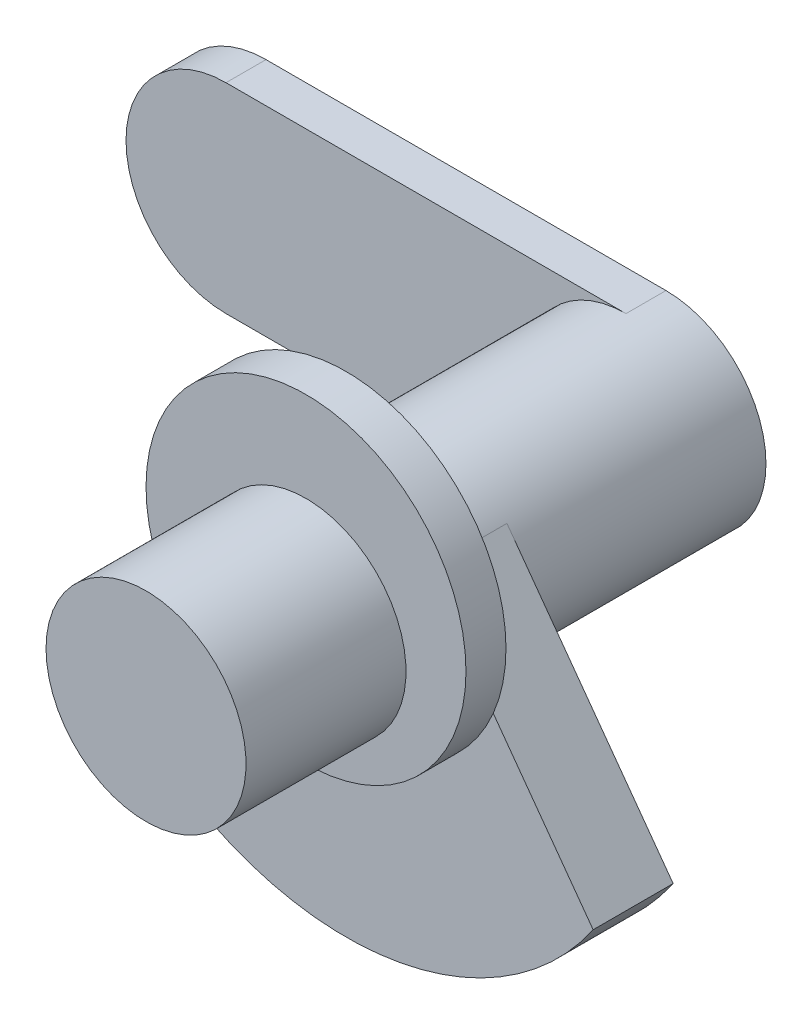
ISO-10303-21;
HEADER;
FILE_DESCRIPTION(('STEP AP214'),'2;1');
FILE_NAME('part.step','',(''),(''),'','','');
FILE_SCHEMA(('AUTOMOTIVE_DESIGN { 1 0 10303 214 1 1 1 1 }'));
ENDSEC;
DATA;
#1=APPLICATION_CONTEXT('core data for automotive mechanical design processes');
#2=APPLICATION_PROTOCOL_DEFINITION('international standard','automotive_design',2000,#1);
#3=PRODUCT_CONTEXT('',#1,'mechanical');
#4=PRODUCT('Part','Part','',(#3));
#5=PRODUCT_RELATED_PRODUCT_CATEGORY('part','',(#4));
#6=PRODUCT_DEFINITION_FORMATION('','',#4);
#7=PRODUCT_DEFINITION_CONTEXT('part definition',#1,'design');
#8=PRODUCT_DEFINITION('design','',#6,#7);
#9=PRODUCT_DEFINITION_SHAPE('','',#8);
#10=(LENGTH_UNIT() NAMED_UNIT(*) SI_UNIT(.MILLI.,.METRE.));
#11=(NAMED_UNIT(*) PLANE_ANGLE_UNIT() SI_UNIT($,.RADIAN.));
#12=(NAMED_UNIT(*) SI_UNIT($,.STERADIAN.) SOLID_ANGLE_UNIT());
#13=UNCERTAINTY_MEASURE_WITH_UNIT(LENGTH_MEASURE(1.E-05),#10,'distance_accuracy_value','');
#14=(GEOMETRIC_REPRESENTATION_CONTEXT(3) GLOBAL_UNCERTAINTY_ASSIGNED_CONTEXT((#13)) GLOBAL_UNIT_ASSIGNED_CONTEXT((#10,
#11,#12)) REPRESENTATION_CONTEXT('',''));
#15=CARTESIAN_POINT('',(0.,0.,0.));
#16=DIRECTION('',(0.,0.,1.));
#17=DIRECTION('',(1.,0.,0.));
#18=AXIS2_PLACEMENT_3D('',#15,#16,#17);
#19=CARTESIAN_POINT('',(0.,0.,152.4));
#20=DIRECTION('',(0.,0.,-1.));
#21=DIRECTION('',(-1.,0.,0.));
#22=AXIS2_PLACEMENT_3D('',#19,#20,#21);
#23=CYLINDRICAL_SURFACE('',#22,63.5);
#24=CARTESIAN_POINT('',(0.,0.,-152.4));
#25=DIRECTION('',(0.,0.,1.));
#26=DIRECTION('',(1.,0.,0.));
#27=AXIS2_PLACEMENT_3D('',#24,#25,#26);
#28=CIRCLE('',#27,63.5);
#29=CARTESIAN_POINT('',(0.,63.5,-152.4));
#30=VERTEX_POINT('',#29);
#31=CARTESIAN_POINT('',(0.,-63.5,-152.4));
#32=VERTEX_POINT('',#31);
#33=EDGE_CURVE('E130',#30,#32,#28,.T.);
#34=ORIENTED_EDGE('',*,*,#33,.T.);
#35=DIRECTION('',(0.,0.,1.));
#36=VECTOR('',#35,1.);
#37=CARTESIAN_POINT('',(0.,-63.5,-177.8));
#38=LINE('',#37,#36);
#39=CARTESIAN_POINT('',(0.,-63.5,-177.8));
#40=VERTEX_POINT('',#39);
#41=EDGE_CURVE('E115',#40,#32,#38,.T.);
#42=ORIENTED_EDGE('',*,*,#41,.F.);
#43=CARTESIAN_POINT('',(0.,0.,-177.8));
#44=DIRECTION('',(0.,0.,-1.));
#45=DIRECTION('',(-1.,0.,0.));
#46=AXIS2_PLACEMENT_3D('',#43,#44,#45);
#47=CIRCLE('',#46,63.5);
#48=CARTESIAN_POINT('',(0.,63.5,-177.8));
#49=VERTEX_POINT('',#48);
#50=EDGE_CURVE('E121',#49,#40,#47,.T.);
#51=ORIENTED_EDGE('',*,*,#50,.F.);
#52=DIRECTION('',(0.,0.,1.));
#53=VECTOR('',#52,1.);
#54=CARTESIAN_POINT('',(0.,63.5,-177.8));
#55=LINE('',#54,#53);
#56=EDGE_CURVE('E53',#49,#30,#55,.T.);
#57=ORIENTED_EDGE('',*,*,#56,.T.);
#58=EDGE_LOOP('',(#34,#42,#51,#57));
#59=FACE_BOUND('',#58,.T.);
#60=DIRECTION('',(0.,0.,1.));
#61=VECTOR('',#60,1.);
#62=CARTESIAN_POINT('',(-51.3725791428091,37.3243635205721,-25.4));
#63=LINE('',#62,#61);
#64=CARTESIAN_POINT('',(-51.3725791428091,37.3243635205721,-25.4));
#65=VERTEX_POINT('',#64);
#66=CARTESIAN_POINT('',(-51.3725791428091,37.3243635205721,25.4));
#67=VERTEX_POINT('',#66);
#68=EDGE_CURVE('E169',#65,#67,#63,.T.);
#69=ORIENTED_EDGE('',*,*,#68,.T.);
#70=CARTESIAN_POINT('',(0.,0.,25.4));
#71=DIRECTION('',(0.,0.,1.));
#72=DIRECTION('',(1.,0.,0.));
#73=AXIS2_PLACEMENT_3D('',#70,#71,#72);
#74=CIRCLE('',#73,63.5);
#75=CARTESIAN_POINT('',(51.3725791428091,37.3243635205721,25.4));
#76=VERTEX_POINT('',#75);
#77=EDGE_CURVE('E11',#76,#67,#74,.T.);
#78=ORIENTED_EDGE('',*,*,#77,.F.);
#79=DIRECTION('',(0.,0.,1.));
#80=VECTOR('',#79,1.);
#81=CARTESIAN_POINT('',(51.3725791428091,37.3243635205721,-25.4));
#82=LINE('',#81,#80);
#83=CARTESIAN_POINT('',(51.3725791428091,37.3243635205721,-25.4));
#84=VERTEX_POINT('',#83);
#85=EDGE_CURVE('E165',#84,#76,#82,.T.);
#86=ORIENTED_EDGE('',*,*,#85,.F.);
#87=CARTESIAN_POINT('',(0.,0.,-25.4));
#88=DIRECTION('',(0.,0.,1.));
#89=DIRECTION('',(1.,0.,0.));
#90=AXIS2_PLACEMENT_3D('',#87,#88,#89);
#91=CIRCLE('',#90,63.5);
#92=EDGE_CURVE('E183',#65,#84,#91,.T.);
#93=ORIENTED_EDGE('',*,*,#92,.F.);
#94=EDGE_LOOP('',(#69,#78,#86,#93));
#95=FACE_BOUND('',#94,.T.);
#96=ADVANCED_FACE('F36',(#59,#95),#23,.T.);
#97=CARTESIAN_POINT('',(0.,0.,50.8));
#98=DIRECTION('',(0.,0.,1.));
#99=DIRECTION('',(1.,0.,0.));
#100=AXIS2_PLACEMENT_3D('',#97,#98,#99);
#101=CIRCLE('',#100,63.5);
#102=CARTESIAN_POINT('',(-63.5,0.,50.8));
#103=VERTEX_POINT('',#102);
#104=EDGE_CURVE('E152',#103,#103,#101,.T.);
#105=CARTESIAN_POINT('',(0.,0.,152.4));
#106=DIRECTION('',(0.,0.,1.));
#107=DIRECTION('',(1.,0.,0.));
#108=AXIS2_PLACEMENT_3D('',#105,#106,#107);
#109=CIRCLE('',#108,63.5);
#110=CARTESIAN_POINT('',(-63.5,0.,152.4));
#111=VERTEX_POINT('',#110);
#112=EDGE_CURVE('E45',#111,#111,#109,.T.);
#113=CARTESIAN_POINT('',(-63.5,0.,50.8));
#114=CARTESIAN_POINT('',(-63.5,0.,51.8583333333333));
#115=CARTESIAN_POINT('',(-63.5,0.,52.9166666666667));
#116=CARTESIAN_POINT('',(-63.5,0.,55.0333333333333));
#117=CARTESIAN_POINT('',(-63.5,0.,56.0916666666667));
#118=CARTESIAN_POINT('',(-63.5,0.,58.2083333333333));
#119=CARTESIAN_POINT('',(-63.5,0.,59.2666666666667));
#120=CARTESIAN_POINT('',(-63.5,0.,61.3833333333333));
#121=CARTESIAN_POINT('',(-63.5,0.,62.4416666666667));
#122=CARTESIAN_POINT('',(-63.5,0.,64.5583333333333));
#123=CARTESIAN_POINT('',(-63.5,0.,65.6166666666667));
#124=CARTESIAN_POINT('',(-63.5,0.,67.7333333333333));
#125=CARTESIAN_POINT('',(-63.5,0.,68.7916666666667));
#126=CARTESIAN_POINT('',(-63.5,0.,70.9083333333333));
#127=CARTESIAN_POINT('',(-63.5,0.,71.9666666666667));
#128=CARTESIAN_POINT('',(-63.5,0.,74.0833333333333));
#129=CARTESIAN_POINT('',(-63.5,0.,75.1416666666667));
#130=CARTESIAN_POINT('',(-63.5,0.,77.2583333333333));
#131=CARTESIAN_POINT('',(-63.5,0.,78.3166666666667));
#132=CARTESIAN_POINT('',(-63.5,0.,80.4333333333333));
#133=CARTESIAN_POINT('',(-63.5,0.,81.4916666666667));
#134=CARTESIAN_POINT('',(-63.5,0.,83.6083333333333));
#135=CARTESIAN_POINT('',(-63.5,0.,84.6666666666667));
#136=CARTESIAN_POINT('',(-63.5,0.,86.7833333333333));
#137=CARTESIAN_POINT('',(-63.5,0.,87.8416666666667));
#138=CARTESIAN_POINT('',(-63.5,0.,89.9583333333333));
#139=CARTESIAN_POINT('',(-63.5,0.,91.0166666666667));
#140=CARTESIAN_POINT('',(-63.5,0.,93.1333333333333));
#141=CARTESIAN_POINT('',(-63.5,0.,94.1916666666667));
#142=CARTESIAN_POINT('',(-63.5,0.,96.3083333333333));
#143=CARTESIAN_POINT('',(-63.5,0.,97.3666666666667));
#144=CARTESIAN_POINT('',(-63.5,0.,99.4833333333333));
#145=CARTESIAN_POINT('',(-63.5,0.,100.541666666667));
#146=CARTESIAN_POINT('',(-63.5,0.,102.658333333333));
#147=CARTESIAN_POINT('',(-63.5,0.,103.716666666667));
#148=CARTESIAN_POINT('',(-63.5,0.,105.833333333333));
#149=CARTESIAN_POINT('',(-63.5,0.,106.891666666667));
#150=CARTESIAN_POINT('',(-63.5,0.,109.008333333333));
#151=CARTESIAN_POINT('',(-63.5,0.,110.066666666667));
#152=CARTESIAN_POINT('',(-63.5,0.,112.183333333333));
#153=CARTESIAN_POINT('',(-63.5,0.,113.241666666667));
#154=CARTESIAN_POINT('',(-63.5,0.,115.358333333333));
#155=CARTESIAN_POINT('',(-63.5,0.,116.416666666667));
#156=CARTESIAN_POINT('',(-63.5,0.,118.533333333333));
#157=CARTESIAN_POINT('',(-63.5,0.,119.591666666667));
#158=CARTESIAN_POINT('',(-63.5,0.,121.708333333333));
#159=CARTESIAN_POINT('',(-63.5,0.,122.766666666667));
#160=CARTESIAN_POINT('',(-63.5,0.,124.883333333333));
#161=CARTESIAN_POINT('',(-63.5,0.,125.941666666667));
#162=CARTESIAN_POINT('',(-63.5,0.,128.058333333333));
#163=CARTESIAN_POINT('',(-63.5,0.,129.116666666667));
#164=CARTESIAN_POINT('',(-63.5,0.,131.233333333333));
#165=CARTESIAN_POINT('',(-63.5,0.,132.291666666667));
#166=CARTESIAN_POINT('',(-63.5,0.,134.408333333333));
#167=CARTESIAN_POINT('',(-63.5,0.,135.466666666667));
#168=CARTESIAN_POINT('',(-63.5,0.,137.583333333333));
#169=CARTESIAN_POINT('',(-63.5,0.,138.641666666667));
#170=CARTESIAN_POINT('',(-63.5,0.,140.758333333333));
#171=CARTESIAN_POINT('',(-63.5,0.,141.816666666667));
#172=CARTESIAN_POINT('',(-63.5,0.,143.933333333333));
#173=CARTESIAN_POINT('',(-63.5,0.,144.991666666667));
#174=CARTESIAN_POINT('',(-63.5,0.,147.108333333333));
#175=CARTESIAN_POINT('',(-63.5,0.,148.166666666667));
#176=CARTESIAN_POINT('',(-63.5,0.,150.283333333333));
#177=CARTESIAN_POINT('',(-63.5,0.,151.341666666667));
#178=CARTESIAN_POINT('',(-63.5,0.,152.4));
#179=B_SPLINE_CURVE_WITH_KNOTS('',3,(#113,#114,#115,#116,#117,#118,#119,#120,#121,#122,#123,
#124,#125,#126,#127,#128,#129,#130,#131,#132,#133,#134,#135,#136,#137,#138,#139,#140,#141,#142,
#143,#144,#145,#146,#147,#148,#149,#150,#151,#152,#153,#154,#155,#156,#157,#158,#159,#160,#161,
#162,#163,#164,#165,#166,#167,#168,#169,#170,#171,#172,#173,#174,#175,#176,#177,#178),
.UNSPECIFIED.,.F.,.F.,(4,2,2,2,2,2,2,2,2,2,2,2,2,2,2,2,2,2,2,2,2,2,2,2,2,2,2,2,2,2,2,2,4),(0.,
3.175,6.34999999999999,9.52500000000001,12.7,15.875,19.05,22.225,25.4,28.575,31.75,34.925,38.1,
41.275,44.45,47.625,50.8,53.975,57.15,60.325,63.5,66.675,69.85,73.025,76.2,79.375,82.55,85.725,
88.9,92.075,95.25,98.425,101.6),.UNSPECIFIED.);
#180=EDGE_CURVE('BSEAM38',#103,#111,#179,.T.);
#181=ORIENTED_EDGE('',*,*,#104,.T.);
#182=ORIENTED_EDGE('',*,*,#112,.F.);
#183=ORIENTED_EDGE('',*,*,#180,.T.);
#184=ORIENTED_EDGE('',*,*,#180,.F.);
#185=EDGE_LOOP('',(#181,#183,#182,#184));
#186=FACE_BOUND('',#185,.T.);
#187=ADVANCED_FACE('F38',(#186),#23,.T.);
#188=CARTESIAN_POINT('',(0.,0.,152.4));
#189=DIRECTION('',(0.,0.,1.));
#190=DIRECTION('',(1.,0.,0.));
#191=AXIS2_PLACEMENT_3D('',#188,#189,#190);
#192=PLANE('',#191);
#193=ORIENTED_EDGE('',*,*,#112,.T.);
#194=EDGE_LOOP('',(#193));
#195=FACE_BOUND('',#194,.T.);
#196=ADVANCED_FACE('F213',(#195),#192,.T.);
#197=CARTESIAN_POINT('',(0.,19.05,50.8));
#198=DIRECTION('',(0.,0.,1.));
#199=DIRECTION('',(1.,0.,0.));
#200=AXIS2_PLACEMENT_3D('',#197,#198,#199);
#201=PLANE('',#200);
#202=CARTESIAN_POINT('',(0.,19.05,50.8));
#203=DIRECTION('',(0.,0.,1.));
#204=DIRECTION('',(1.,0.,0.));
#205=AXIS2_PLACEMENT_3D('',#202,#203,#204);
#206=CIRCLE('',#205,101.6);
#207=CARTESIAN_POINT('',(101.6,19.05,50.8));
#208=VERTEX_POINT('',#207);
#209=EDGE_CURVE('E154',#208,#208,#206,.T.);
#210=ORIENTED_EDGE('',*,*,#209,.T.);
#211=EDGE_LOOP('',(#210));
#212=FACE_BOUND('',#211,.T.);
#213=ORIENTED_EDGE('',*,*,#104,.F.);
#214=EDGE_LOOP('',(#213));
#215=FACE_BOUND('',#214,.T.);
#216=ADVANCED_FACE('F218',(#212,#215),#201,.T.);
#217=CARTESIAN_POINT('',(0.,19.05,25.4));
#218=DIRECTION('',(0.,0.,1.));
#219=DIRECTION('',(1.,0.,0.));
#220=AXIS2_PLACEMENT_3D('',#217,#218,#219);
#221=PLANE('',#220);
#222=ORIENTED_EDGE('',*,*,#77,.T.);
#223=DIRECTION('',(-0.587785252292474,-0.809016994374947,0.));
#224=VECTOR('',#223,1.);
#225=CARTESIAN_POINT('',(-51.3725791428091,37.3243635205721,25.4));
#226=LINE('',#225,#224);
#227=CARTESIAN_POINT('',(-93.5118133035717,-20.6753165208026,25.4));
#228=VERTEX_POINT('',#227);
#229=EDGE_CURVE('E174',#67,#228,#226,.T.);
#230=ORIENTED_EDGE('',*,*,#229,.T.);
#231=CARTESIAN_POINT('',(0.,19.05,25.4));
#232=DIRECTION('',(0.,0.,1.));
#233=DIRECTION('',(1.,0.,0.));
#234=AXIS2_PLACEMENT_3D('',#231,#232,#233);
#235=CIRCLE('',#234,101.6);
#236=CARTESIAN_POINT('',(93.5118133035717,-20.6753165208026,25.4));
#237=VERTEX_POINT('',#236);
#238=EDGE_CURVE('E61',#237,#228,#235,.T.);
#239=ORIENTED_EDGE('',*,*,#238,.F.);
#240=DIRECTION('',(0.587785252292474,-0.809016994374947,0.));
#241=VECTOR('',#240,1.);
#242=CARTESIAN_POINT('',(51.3725791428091,37.3243635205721,25.4));
#243=LINE('',#242,#241);
#244=EDGE_CURVE('E178',#76,#237,#243,.T.);
#245=ORIENTED_EDGE('',*,*,#244,.F.);
#246=EDGE_LOOP('',(#222,#230,#239,#245));
#247=FACE_BOUND('',#246,.T.);
#248=ADVANCED_FACE('F225',(#247),#221,.F.);
#249=CARTESIAN_POINT('',(0.,19.05,50.8));
#250=DIRECTION('',(0.,0.,-1.));
#251=DIRECTION('',(-1.,0.,0.));
#252=AXIS2_PLACEMENT_3D('',#249,#250,#251);
#253=CYLINDRICAL_SURFACE('',#252,101.6);
#254=ORIENTED_EDGE('',*,*,#209,.F.);
#255=EDGE_LOOP('',(#254));
#256=FACE_BOUND('',#255,.T.);
#257=EDGE_CURVE('E158',#228,#237,#235,.T.);
#258=ORIENTED_EDGE('',*,*,#257,.T.);
#259=ORIENTED_EDGE('',*,*,#238,.T.);
#260=EDGE_LOOP('',(#258,#259));
#261=FACE_BOUND('',#260,.T.);
#262=ADVANCED_FACE('F231',(#256,#261),#253,.T.);
#263=CARTESIAN_POINT('',(0.,0.,25.4));
#264=DIRECTION('',(0.,0.,1.));
#265=DIRECTION('',(1.,0.,0.));
#266=AXIS2_PLACEMENT_3D('',#263,#264,#265);
#267=PLANE('',#266);
#268=ORIENTED_EDGE('',*,*,#257,.F.);
#269=CARTESIAN_POINT('',(-156.941821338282,-107.97923279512,25.4));
#270=VERTEX_POINT('',#269);
#271=EDGE_CURVE('E177',#228,#270,#226,.T.);
#272=ORIENTED_EDGE('',*,*,#271,.T.);
#273=CARTESIAN_POINT('',(0.,3.19189119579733E-13,25.4));
#274=DIRECTION('',(0.,0.,1.));
#275=DIRECTION('',(1.,0.,0.));
#276=AXIS2_PLACEMENT_3D('',#273,#274,#275);
#277=CIRCLE('',#276,190.5);
#278=CARTESIAN_POINT('',(156.941821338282,-107.97923279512,25.4));
#279=VERTEX_POINT('',#278);
#280=EDGE_CURVE('E131',#279,#270,#277,.F.);
#281=ORIENTED_EDGE('',*,*,#280,.F.);
#282=EDGE_CURVE('E133',#237,#279,#243,.T.);
#283=ORIENTED_EDGE('',*,*,#282,.F.);
#284=EDGE_LOOP('',(#268,#272,#281,#283));
#285=FACE_BOUND('',#284,.T.);
#286=ADVANCED_FACE('F238',(#285),#267,.T.);
#287=CARTESIAN_POINT('',(0.,3.19189119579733E-13,-25.4));
#288=DIRECTION('',(0.,0.,1.));
#289=DIRECTION('',(1.,0.,0.));
#290=AXIS2_PLACEMENT_3D('',#287,#288,#289);
#291=CYLINDRICAL_SURFACE('',#290,190.5);
#292=ORIENTED_EDGE('',*,*,#280,.T.);
#293=DIRECTION('',(0.,0.,1.));
#294=VECTOR('',#293,1.);
#295=CARTESIAN_POINT('',(-156.941821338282,-107.97923279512,-25.4));
#296=LINE('',#295,#294);
#297=CARTESIAN_POINT('',(-156.941821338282,-107.97923279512,-25.4));
#298=VERTEX_POINT('',#297);
#299=EDGE_CURVE('E171',#298,#270,#296,.T.);
#300=ORIENTED_EDGE('',*,*,#299,.F.);
#301=CARTESIAN_POINT('',(0.,3.19189119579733E-13,-25.4));
#302=DIRECTION('',(0.,0.,1.));
#303=DIRECTION('',(1.,0.,0.));
#304=AXIS2_PLACEMENT_3D('',#301,#302,#303);
#305=CIRCLE('',#304,190.5);
#306=CARTESIAN_POINT('',(156.941821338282,-107.97923279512,-25.4));
#307=VERTEX_POINT('',#306);
#308=EDGE_CURVE('E176',#307,#298,#305,.F.);
#309=ORIENTED_EDGE('',*,*,#308,.F.);
#310=DIRECTION('',(0.,0.,1.));
#311=VECTOR('',#310,1.);
#312=CARTESIAN_POINT('',(156.941821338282,-107.97923279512,-25.4));
#313=LINE('',#312,#311);
#314=EDGE_CURVE('E162',#307,#279,#313,.T.);
#315=ORIENTED_EDGE('',*,*,#314,.T.);
#316=EDGE_LOOP('',(#292,#300,#309,#315));
#317=FACE_BOUND('',#316,.T.);
#318=ADVANCED_FACE('F234',(#317),#291,.T.);
#319=CARTESIAN_POINT('',(-51.3725791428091,37.3243635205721,-25.4));
#320=DIRECTION('',(-0.809016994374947,0.587785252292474,0.));
#321=DIRECTION('',(-0.587785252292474,-0.809016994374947,0.));
#322=AXIS2_PLACEMENT_3D('',#319,#320,#321);
#323=PLANE('',#322);
#324=ORIENTED_EDGE('',*,*,#229,.F.);
#325=ORIENTED_EDGE('',*,*,#68,.F.);
#326=DIRECTION('',(-0.587785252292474,-0.809016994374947,0.));
#327=VECTOR('',#326,1.);
#328=CARTESIAN_POINT('',(-51.3725791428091,37.3243635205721,-25.4));
#329=LINE('',#328,#327);
#330=EDGE_CURVE('E166',#65,#298,#329,.T.);
#331=ORIENTED_EDGE('',*,*,#330,.T.);
#332=ORIENTED_EDGE('',*,*,#299,.T.);
#333=ORIENTED_EDGE('',*,*,#271,.F.);
#334=EDGE_LOOP('',(#324,#325,#331,#332,#333));
#335=FACE_BOUND('',#334,.T.);
#336=ADVANCED_FACE('F260',(#335),#323,.T.);
#337=CARTESIAN_POINT('',(51.3725791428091,37.3243635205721,-25.4));
#338=DIRECTION('',(-0.809016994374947,-0.587785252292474,0.));
#339=DIRECTION('',(0.587785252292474,-0.809016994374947,0.));
#340=AXIS2_PLACEMENT_3D('',#337,#338,#339);
#341=PLANE('',#340);
#342=ORIENTED_EDGE('',*,*,#244,.T.);
#343=ORIENTED_EDGE('',*,*,#282,.T.);
#344=ORIENTED_EDGE('',*,*,#314,.F.);
#345=DIRECTION('',(0.587785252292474,-0.809016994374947,0.));
#346=VECTOR('',#345,1.);
#347=CARTESIAN_POINT('',(51.3725791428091,37.3243635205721,-25.4));
#348=LINE('',#347,#346);
#349=EDGE_CURVE('E186',#84,#307,#348,.T.);
#350=ORIENTED_EDGE('',*,*,#349,.F.);
#351=ORIENTED_EDGE('',*,*,#85,.T.);
#352=EDGE_LOOP('',(#342,#343,#344,#350,#351));
#353=FACE_BOUND('',#352,.T.);
#354=ADVANCED_FACE('F253',(#353),#341,.F.);
#355=CARTESIAN_POINT('',(0.,0.,-25.4));
#356=DIRECTION('',(0.,0.,1.));
#357=DIRECTION('',(1.,0.,0.));
#358=AXIS2_PLACEMENT_3D('',#355,#356,#357);
#359=PLANE('',#358);
#360=ORIENTED_EDGE('',*,*,#308,.T.);
#361=ORIENTED_EDGE('',*,*,#330,.F.);
#362=ORIENTED_EDGE('',*,*,#92,.T.);
#363=ORIENTED_EDGE('',*,*,#349,.T.);
#364=EDGE_LOOP('',(#360,#361,#362,#363));
#365=FACE_BOUND('',#364,.T.);
#366=ADVANCED_FACE('F262',(#365),#359,.F.);
#367=CARTESIAN_POINT('',(0.,-63.5,-177.8));
#368=DIRECTION('',(0.,1.,0.));
#369=DIRECTION('',(0.,0.,1.));
#370=AXIS2_PLACEMENT_3D('',#367,#368,#369);
#371=PLANE('',#370);
#372=DIRECTION('',(-1.,0.,0.));
#373=VECTOR('',#372,1.);
#374=CARTESIAN_POINT('',(0.,-63.5,-152.4));
#375=LINE('',#374,#373);
#376=CARTESIAN_POINT('',(-254.,-63.5,-152.4));
#377=VERTEX_POINT('',#376);
#378=EDGE_CURVE('E140',#32,#377,#375,.T.);
#379=ORIENTED_EDGE('',*,*,#378,.T.);
#380=DIRECTION('',(0.,0.,1.));
#381=VECTOR('',#380,1.);
#382=CARTESIAN_POINT('',(-254.,-63.5,-177.8));
#383=LINE('',#382,#381);
#384=CARTESIAN_POINT('',(-254.,-63.5,-177.8));
#385=VERTEX_POINT('',#384);
#386=EDGE_CURVE('E117',#385,#377,#383,.T.);
#387=ORIENTED_EDGE('',*,*,#386,.F.);
#388=DIRECTION('',(-1.,0.,0.));
#389=VECTOR('',#388,1.);
#390=CARTESIAN_POINT('',(0.,-63.5,-177.8));
#391=LINE('',#390,#389);
#392=EDGE_CURVE('E111',#40,#385,#391,.T.);
#393=ORIENTED_EDGE('',*,*,#392,.F.);
#394=ORIENTED_EDGE('',*,*,#41,.T.);
#395=EDGE_LOOP('',(#379,#387,#393,#394));
#396=FACE_BOUND('',#395,.T.);
#397=ADVANCED_FACE('F113',(#396),#371,.F.);
#398=CARTESIAN_POINT('',(-254.,0.,-177.8));
#399=DIRECTION('',(0.,0.,1.));
#400=DIRECTION('',(1.,0.,0.));
#401=AXIS2_PLACEMENT_3D('',#398,#399,#400);
#402=CYLINDRICAL_SURFACE('',#401,63.5);
#403=CARTESIAN_POINT('',(-254.,0.,-152.4));
#404=DIRECTION('',(0.,0.,-1.));
#405=DIRECTION('',(1.,0.,0.));
#406=AXIS2_PLACEMENT_3D('',#403,#404,#405);
#407=CIRCLE('',#406,63.5);
#408=CARTESIAN_POINT('',(-254.,63.5,-152.4));
#409=VERTEX_POINT('',#408);
#410=EDGE_CURVE('E142',#377,#409,#407,.T.);
#411=ORIENTED_EDGE('',*,*,#410,.T.);
#412=DIRECTION('',(0.,0.,1.));
#413=VECTOR('',#412,1.);
#414=CARTESIAN_POINT('',(-254.,63.5,-177.8));
#415=LINE('',#414,#413);
#416=CARTESIAN_POINT('',(-254.,63.5,-177.8));
#417=VERTEX_POINT('',#416);
#418=EDGE_CURVE('E135',#417,#409,#415,.T.);
#419=ORIENTED_EDGE('',*,*,#418,.F.);
#420=CARTESIAN_POINT('',(-254.,0.,-177.8));
#421=DIRECTION('',(0.,0.,-1.));
#422=DIRECTION('',(1.,0.,0.));
#423=AXIS2_PLACEMENT_3D('',#420,#421,#422);
#424=CIRCLE('',#423,63.5);
#425=EDGE_CURVE('E120',#385,#417,#424,.T.);
#426=ORIENTED_EDGE('',*,*,#425,.F.);
#427=ORIENTED_EDGE('',*,*,#386,.T.);
#428=EDGE_LOOP('',(#411,#419,#426,#427));
#429=FACE_BOUND('',#428,.T.);
#430=ADVANCED_FACE('F195',(#429),#402,.T.);
#431=CARTESIAN_POINT('',(0.,63.5,-177.8));
#432=DIRECTION('',(0.,-1.,0.));
#433=DIRECTION('',(0.,0.,-1.));
#434=AXIS2_PLACEMENT_3D('',#431,#432,#433);
#435=PLANE('',#434);
#436=DIRECTION('',(1.,0.,0.));
#437=VECTOR('',#436,1.);
#438=CARTESIAN_POINT('',(0.,63.5,-152.4));
#439=LINE('',#438,#437);
#440=EDGE_CURVE('E126',#409,#30,#439,.T.);
#441=ORIENTED_EDGE('',*,*,#440,.T.);
#442=ORIENTED_EDGE('',*,*,#56,.F.);
#443=DIRECTION('',(1.,0.,0.));
#444=VECTOR('',#443,1.);
#445=CARTESIAN_POINT('',(0.,63.5,-177.8));
#446=LINE('',#445,#444);
#447=EDGE_CURVE('E125',#417,#49,#446,.T.);
#448=ORIENTED_EDGE('',*,*,#447,.F.);
#449=ORIENTED_EDGE('',*,*,#418,.T.);
#450=EDGE_LOOP('',(#441,#442,#448,#449));
#451=FACE_BOUND('',#450,.T.);
#452=ADVANCED_FACE('F199',(#451),#435,.F.);
#453=CARTESIAN_POINT('',(0.,0.,-177.8));
#454=DIRECTION('',(0.,0.,-1.));
#455=DIRECTION('',(-1.,0.,0.));
#456=AXIS2_PLACEMENT_3D('',#453,#454,#455);
#457=PLANE('',#456);
#458=ORIENTED_EDGE('',*,*,#50,.T.);
#459=ORIENTED_EDGE('',*,*,#392,.T.);
#460=ORIENTED_EDGE('',*,*,#425,.T.);
#461=ORIENTED_EDGE('',*,*,#447,.T.);
#462=EDGE_LOOP('',(#458,#459,#460,#461));
#463=FACE_BOUND('',#462,.T.);
#464=ADVANCED_FACE('F123',(#463),#457,.T.);
#465=CARTESIAN_POINT('',(0.,0.,-152.4));
#466=DIRECTION('',(0.,0.,-1.));
#467=DIRECTION('',(-1.,0.,0.));
#468=AXIS2_PLACEMENT_3D('',#465,#466,#467);
#469=PLANE('',#468);
#470=ORIENTED_EDGE('',*,*,#33,.F.);
#471=ORIENTED_EDGE('',*,*,#440,.F.);
#472=ORIENTED_EDGE('',*,*,#410,.F.);
#473=ORIENTED_EDGE('',*,*,#378,.F.);
#474=EDGE_LOOP('',(#470,#471,#472,#473));
#475=FACE_BOUND('',#474,.T.);
#476=ADVANCED_FACE('F201',(#475),#469,.F.);
#477=CLOSED_SHELL('',(#96,#187,#196,#216,#248,#262,#286,#318,#336,#354,#366,#397,#430,#452,#464,#476));
#478=MANIFOLD_SOLID_BREP('B2',#477);
#479=ADVANCED_BREP_SHAPE_REPRESENTATION('',(#18,#478),#14);
#480=SHAPE_DEFINITION_REPRESENTATION(#9,#479);
ENDSEC;
END-ISO-10303-21;
